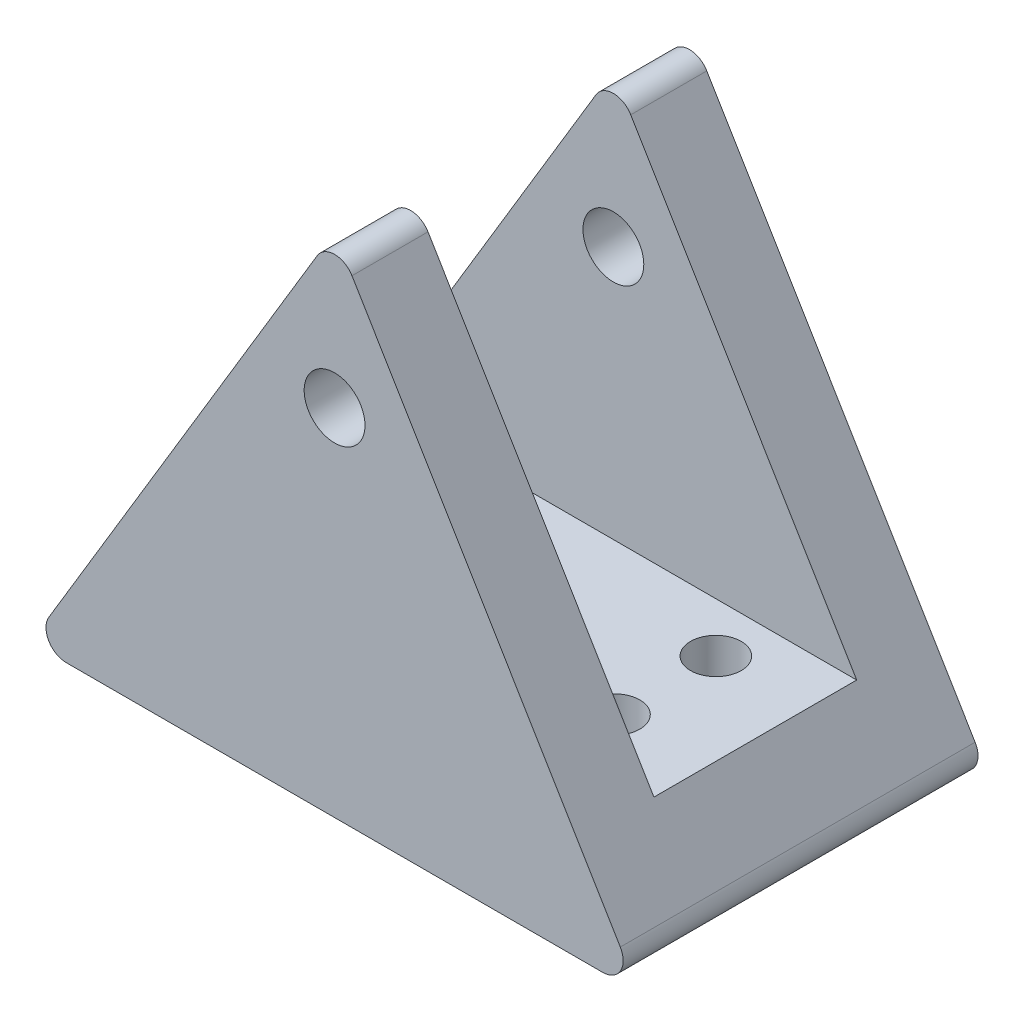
from build123d import *

# Parameters (mm, degrees)
SKETCH2_W           = 76.2
SKETCH2_H           = 63.5
BOSS_EXTRUDE1_DEPTH = 44.45
SKETCH5_W           = 25.4
SKETCH5_H           = 50.8
CUT_EXTRUDE3_DEPTH  = 94.756626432
CUT_EXTRUDE4_DEPTH  = 44.45
CUT_EXTRUDE5_DEPTH  = 67.599361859
SKETCH7_R           = 3.175
CUT_EXTRUDE6_DEPTH  = 44.45
SKETCH8_R           = 3.81
CUT_EXTRUDE7_DEPTH  = 67.599361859
FILLET3_R           = 2.54


with BuildPart() as part:
    # Sketch2 → Boss-Extrude1 (new body)
    with BuildSketch(Plane.XY):
        Rectangle(SKETCH2_W, SKETCH2_H)
    extrude(amount=BOSS_EXTRUDE1_DEPTH)

    # Sketch5 → Cut-Extrude3 (cut, through all)
    with BuildSketch(Plane(origin=(38.1, 0, 0), x_dir=(0, 0, -1), z_dir=(1, 0, 0))):
        with Locations((-22.225, 6.35)):
            Rectangle(SKETCH5_W, SKETCH5_H)
    extrude(amount=-CUT_EXTRUDE3_DEPTH, mode=Mode.SUBTRACT)

    # Sketch3 → Cut-Extrude4 (cut)
    with BuildSketch(Plane.XY.offset(44.45)):
        Polygon((-38.1, -31.75), (0, 31.75), (-38.1, 31.75), align=None)
    extrude(amount=-CUT_EXTRUDE4_DEPTH, mode=Mode.SUBTRACT)

    # Sketch6 → Cut-Extrude5 (cut, through all)
    with BuildSketch(Plane.XY.offset(44.45)):
        Polygon((0, 31.75), (38.1, -31.75), (38.1, 31.75), align=None)
    extrude(amount=-CUT_EXTRUDE5_DEPTH, mode=Mode.SUBTRACT)

    # Sketch7 → Cut-Extrude6 (cut)
    with BuildSketch(Plane(origin=(0, -19.05, 0), x_dir=(1, 0, 0), z_dir=(0, 1, 0))):
        with Locations(Location((-19.05, -15.737033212, 0), (0, 0, 180))):
            Circle(SKETCH7_R)
        with Locations(Location((19.05, -15.737033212, 0), (0, 0, 270))):
            Circle(SKETCH7_R)
        with Locations(Location((19.05, -28.437033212, 0), (0, 0, 180))):
            Circle(SKETCH7_R)
        with Locations(Location((-19.05, -28.437033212, 0), (0, 0, 270))):
            Circle(SKETCH7_R)
    extrude(amount=-CUT_EXTRUDE6_DEPTH, mode=Mode.SUBTRACT)

    # Sketch8 → Cut-Extrude7 (cut, through all)
    with BuildSketch(Plane.XY.offset(44.45)):
        with Locations((0, 12.7)):
            Circle(SKETCH8_R)
    extrude(amount=-CUT_EXTRUDE7_DEPTH, mode=Mode.SUBTRACT)

    # Fillet3
    fillet3_edges = [part.edges().sort_by_distance(p)[0] for p in [
        (0, 31.75, 4.7625),
        (0, 31.75, 39.6875),
        (38.1, -31.75, 22.225),
        (-38.1, -31.75, 22.225),
    ]]
    fillet(fillet3_edges, radius=FILLET3_R)


solid = part.part
